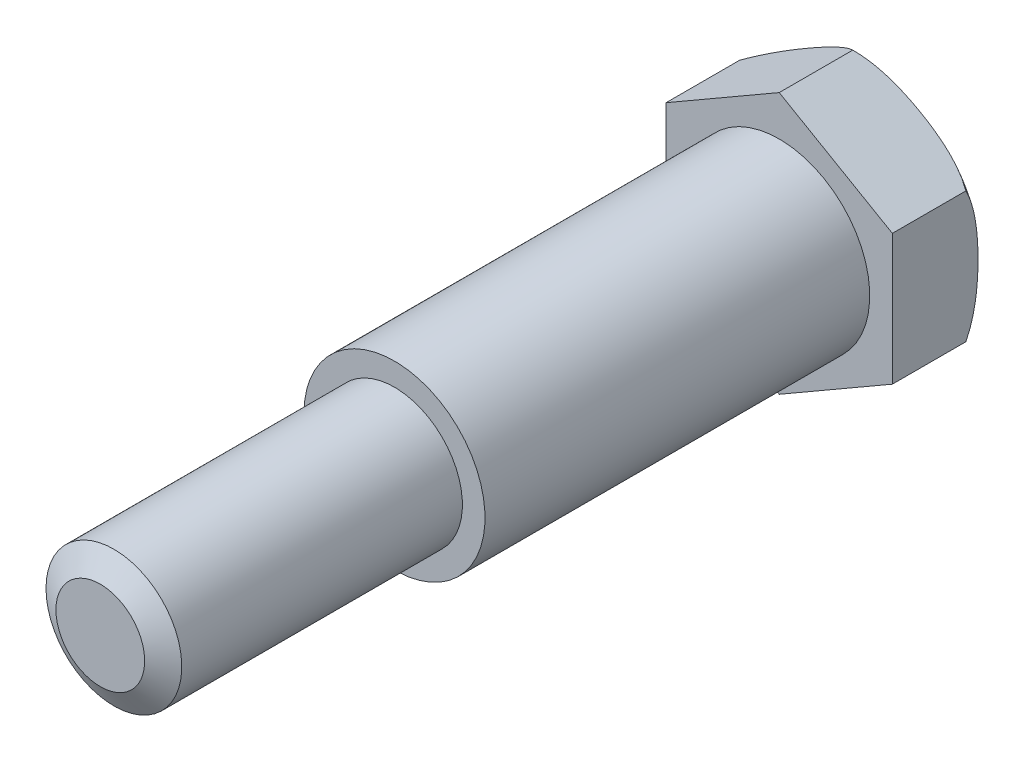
ISO-10303-21;
HEADER;
FILE_DESCRIPTION(('STEP AP214'),'2;1');
FILE_NAME('part.step','',(''),(''),'','','');
FILE_SCHEMA(('AUTOMOTIVE_DESIGN { 1 0 10303 214 1 1 1 1 }'));
ENDSEC;
DATA;
#1=APPLICATION_CONTEXT('core data for automotive mechanical design processes');
#2=APPLICATION_PROTOCOL_DEFINITION('international standard','automotive_design',2000,#1);
#3=PRODUCT_CONTEXT('',#1,'mechanical');
#4=PRODUCT('Part','Part','',(#3));
#5=PRODUCT_RELATED_PRODUCT_CATEGORY('part','',(#4));
#6=PRODUCT_DEFINITION_FORMATION('','',#4);
#7=PRODUCT_DEFINITION_CONTEXT('part definition',#1,'design');
#8=PRODUCT_DEFINITION('design','',#6,#7);
#9=PRODUCT_DEFINITION_SHAPE('','',#8);
#10=(LENGTH_UNIT() NAMED_UNIT(*) SI_UNIT(.MILLI.,.METRE.));
#11=(NAMED_UNIT(*) PLANE_ANGLE_UNIT() SI_UNIT($,.RADIAN.));
#12=(NAMED_UNIT(*) SI_UNIT($,.STERADIAN.) SOLID_ANGLE_UNIT());
#13=UNCERTAINTY_MEASURE_WITH_UNIT(LENGTH_MEASURE(1.E-05),#10,'distance_accuracy_value','');
#14=(GEOMETRIC_REPRESENTATION_CONTEXT(3) GLOBAL_UNCERTAINTY_ASSIGNED_CONTEXT((#13)) GLOBAL_UNIT_ASSIGNED_CONTEXT((#10,
#11,#12)) REPRESENTATION_CONTEXT('',''));
#15=CARTESIAN_POINT('',(0.,0.,0.));
#16=DIRECTION('',(0.,0.,1.));
#17=DIRECTION('',(1.,0.,0.));
#18=AXIS2_PLACEMENT_3D('',#15,#16,#17);
#19=CARTESIAN_POINT('',(0.,0.,21.));
#20=DIRECTION('',(0.,0.,1.));
#21=DIRECTION('',(1.,0.,0.));
#22=AXIS2_PLACEMENT_3D('',#19,#20,#21);
#23=PLANE('',#22);
#24=CARTESIAN_POINT('',(0.,0.,21.));
#25=DIRECTION('',(0.,0.,1.));
#26=DIRECTION('',(1.,0.,0.));
#27=AXIS2_PLACEMENT_3D('',#24,#25,#26);
#28=CIRCLE('',#27,4.);
#29=CARTESIAN_POINT('',(-4.,0.,21.));
#30=VERTEX_POINT('',#29);
#31=EDGE_CURVE('E223',#30,#30,#28,.T.);
#32=ORIENTED_EDGE('',*,*,#31,.T.);
#33=EDGE_LOOP('',(#32));
#34=FACE_BOUND('',#33,.T.);
#35=CARTESIAN_POINT('',(0.,0.,21.));
#36=DIRECTION('',(0.,0.,1.));
#37=DIRECTION('',(1.,0.,0.));
#38=AXIS2_PLACEMENT_3D('',#35,#36,#37);
#39=CIRCLE('',#38,3.);
#40=CARTESIAN_POINT('',(-2.99999999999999,0.,21.));
#41=VERTEX_POINT('',#40);
#42=EDGE_CURVE('E224',#41,#41,#39,.T.);
#43=ORIENTED_EDGE('',*,*,#42,.F.);
#44=EDGE_LOOP('',(#43));
#45=FACE_BOUND('',#44,.T.);
#46=ADVANCED_FACE('F24',(#34,#45),#23,.T.);
#47=CARTESIAN_POINT('',(0.,5.77350269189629,4.));
#48=DIRECTION('',(0.,0.,1.));
#49=DIRECTION('',(1.,0.,0.));
#50=AXIS2_PLACEMENT_3D('',#47,#48,#49);
#51=PLANE('',#50);
#52=DIRECTION('',(-0.866025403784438,0.5,0.));
#53=VECTOR('',#52,1.);
#54=CARTESIAN_POINT('',(4.99999999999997,2.88675134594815,4.));
#55=LINE('',#54,#53);
#56=CARTESIAN_POINT('',(4.99999999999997,2.88675134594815,4.));
#57=VERTEX_POINT('',#56);
#58=CARTESIAN_POINT('',(0.,5.77350269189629,4.));
#59=VERTEX_POINT('',#58);
#60=EDGE_CURVE('E218',#57,#59,#55,.T.);
#61=ORIENTED_EDGE('',*,*,#60,.T.);
#62=DIRECTION('',(-0.866025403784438,-0.5,0.));
#63=VECTOR('',#62,1.);
#64=CARTESIAN_POINT('',(0.,5.77350269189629,4.));
#65=LINE('',#64,#63);
#66=CARTESIAN_POINT('',(-5.00000000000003,2.88675134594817,4.));
#67=VERTEX_POINT('',#66);
#68=EDGE_CURVE('E204',#59,#67,#65,.T.);
#69=ORIENTED_EDGE('',*,*,#68,.T.);
#70=DIRECTION('',(0.,-1.,0.));
#71=VECTOR('',#70,1.);
#72=CARTESIAN_POINT('',(-5.00000000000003,2.88675134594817,4.));
#73=LINE('',#72,#71);
#74=CARTESIAN_POINT('',(-5.00000000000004,-2.8867513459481,4.));
#75=VERTEX_POINT('',#74);
#76=EDGE_CURVE('E98',#67,#75,#73,.T.);
#77=ORIENTED_EDGE('',*,*,#76,.T.);
#78=DIRECTION('',(0.866025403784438,-0.5,0.));
#79=VECTOR('',#78,1.);
#80=CARTESIAN_POINT('',(-5.00000000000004,-2.8867513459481,4.));
#81=LINE('',#80,#79);
#82=CARTESIAN_POINT('',(0.,-5.77350269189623,4.));
#83=VERTEX_POINT('',#82);
#84=EDGE_CURVE('E199',#75,#83,#81,.T.);
#85=ORIENTED_EDGE('',*,*,#84,.T.);
#86=DIRECTION('',(0.866025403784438,0.5,0.));
#87=VECTOR('',#86,1.);
#88=CARTESIAN_POINT('',(0.,-5.77350269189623,4.));
#89=LINE('',#88,#87);
#90=CARTESIAN_POINT('',(4.99999999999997,-2.88675134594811,4.));
#91=VERTEX_POINT('',#90);
#92=EDGE_CURVE('E201',#83,#91,#89,.T.);
#93=ORIENTED_EDGE('',*,*,#92,.T.);
#94=DIRECTION('',(0.,1.,0.));
#95=VECTOR('',#94,1.);
#96=CARTESIAN_POINT('',(4.99999999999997,-2.88675134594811,4.));
#97=LINE('',#96,#95);
#98=EDGE_CURVE('E48',#91,#57,#97,.T.);
#99=ORIENTED_EDGE('',*,*,#98,.T.);
#100=EDGE_LOOP('',(#61,#69,#77,#85,#93,#99));
#101=FACE_BOUND('',#100,.T.);
#102=CARTESIAN_POINT('',(0.,0.,4.));
#103=DIRECTION('',(0.,0.,1.));
#104=DIRECTION('',(1.,0.,0.));
#105=AXIS2_PLACEMENT_3D('',#102,#103,#104);
#106=CIRCLE('',#105,4.);
#107=CARTESIAN_POINT('',(-4.,0.,4.));
#108=VERTEX_POINT('',#107);
#109=EDGE_CURVE('E221',#108,#108,#106,.T.);
#110=ORIENTED_EDGE('',*,*,#109,.F.);
#111=EDGE_LOOP('',(#110));
#112=FACE_BOUND('',#111,.T.);
#113=ADVANCED_FACE('F126',(#101,#112),#51,.T.);
#114=CARTESIAN_POINT('',(4.99999999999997,2.88675134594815,4.));
#115=DIRECTION('',(-0.5,-0.866025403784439,0.));
#116=DIRECTION('',(0.866025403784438,-0.5,0.));
#117=AXIS2_PLACEMENT_3D('',#114,#115,#116);
#118=PLANE('',#117);
#119=DIRECTION('',(0.,0.,-1.));
#120=VECTOR('',#119,1.);
#121=CARTESIAN_POINT('',(4.99999999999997,2.88675134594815,4.));
#122=LINE('',#121,#120);
#123=CARTESIAN_POINT('',(4.99999999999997,2.88675134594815,0.750000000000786));
#124=VERTEX_POINT('',#123);
#125=EDGE_CURVE('E209',#57,#124,#122,.T.);
#126=ORIENTED_EDGE('',*,*,#125,.T.);
#127=CARTESIAN_POINT('',(5.00019999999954,2.88663587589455,0.750117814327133));
#128=CARTESIAN_POINT('',(4.91841205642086,2.93385616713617,0.701964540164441));
#129=CARTESIAN_POINT('',(4.83475354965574,2.98215642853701,0.658318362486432));
#130=CARTESIAN_POINT('',(4.6648047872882,3.08027639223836,0.579129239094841));
#131=CARTESIAN_POINT('',(4.57852070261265,3.13009253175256,0.543568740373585));
#132=CARTESIAN_POINT('',(4.40402751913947,3.23083621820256,0.479424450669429));
#133=CARTESIAN_POINT('',(4.31581764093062,3.28176421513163,0.450843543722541));
#134=CARTESIAN_POINT('',(4.13804944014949,3.38439873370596,0.399719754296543));
#135=CARTESIAN_POINT('',(4.04849028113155,3.43610573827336,0.377180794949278));
#136=CARTESIAN_POINT('',(3.8550726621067,3.54777545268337,0.334331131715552));
#137=CARTESIAN_POINT('',(3.75107696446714,3.60781739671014,0.314856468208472));
#138=CARTESIAN_POINT('',(3.54238396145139,3.72830635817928,0.281675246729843));
#139=CARTESIAN_POINT('',(3.43768646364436,3.78875348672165,0.267970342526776));
#140=CARTESIAN_POINT('',(3.22779422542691,3.90993482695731,0.245453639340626));
#141=CARTESIAN_POINT('',(3.12259907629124,3.97066927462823,0.236647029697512));
#142=CARTESIAN_POINT('',(2.91202017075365,4.09224706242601,0.223338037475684));
#143=CARTESIAN_POINT('',(2.80663643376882,4.15309039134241,0.218835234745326));
#144=CARTESIAN_POINT('',(2.59551554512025,4.27498109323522,0.213794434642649));
#145=CARTESIAN_POINT('',(2.4897782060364,4.33602857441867,0.213267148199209));
#146=CARTESIAN_POINT('',(2.27833668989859,4.4581043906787,0.21616576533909));
#147=CARTESIAN_POINT('',(2.17263251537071,4.51913272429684,0.219591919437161));
#148=CARTESIAN_POINT('',(1.96144359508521,4.64106270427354,0.230650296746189));
#149=CARTESIAN_POINT('',(1.85595875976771,4.70196440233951,0.238280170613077));
#150=CARTESIAN_POINT('',(1.64533731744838,4.8235667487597,0.258285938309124));
#151=CARTESIAN_POINT('',(1.54020066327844,4.88426742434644,0.270661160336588));
#152=CARTESIAN_POINT('',(1.31113210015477,5.01652022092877,0.303766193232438));
#153=CARTESIAN_POINT('',(1.18731688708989,5.08800496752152,0.325617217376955));
#154=CARTESIAN_POINT('',(0.941365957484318,5.23000480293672,0.378866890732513));
#155=CARTESIAN_POINT('',(0.819228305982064,5.30052100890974,0.410253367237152));
#156=CARTESIAN_POINT('',(0.578303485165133,5.43961901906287,0.484573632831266));
#157=CARTESIAN_POINT('',(0.459500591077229,5.50820990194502,0.52743688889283));
#158=CARTESIAN_POINT('',(0.284435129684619,5.60928399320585,0.602347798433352));
#159=CARTESIAN_POINT('',(0.226483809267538,5.64274220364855,0.629155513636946));
#160=CARTESIAN_POINT('',(0.11199152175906,5.7088443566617,0.686648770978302));
#161=CARTESIAN_POINT('',(0.0554517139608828,5.74148762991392,0.717337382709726));
#162=CARTESIAN_POINT('',(-0.000200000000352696,5.7736181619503,0.750117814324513));
#163=B_SPLINE_CURVE_WITH_KNOTS('',3,(#127,#128,#129,#130,#131,#132,#133,#134,#135,#136,#137,
#138,#139,#140,#141,#142,#143,#144,#145,#146,#147,#148,#149,#150,#151,#152,#153,#154,#155,#156,
#157,#158,#159,#160,#161,#162),.UNSPECIFIED.,.F.,.F.,(4,2,2,2,2,2,2,2,2,2,2,2,2,2,2,2,2,4),(0.,
0.317729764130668,0.634763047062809,0.951927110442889,1.2692966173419,1.63408330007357,
1.99897446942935,2.36425147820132,2.72949282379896,3.09571786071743,3.46196610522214,
3.8280098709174,4.19400183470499,4.62762059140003,5.06068811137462,5.49115289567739,
5.70730227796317,5.92362370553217),.UNSPECIFIED.);
#164=CARTESIAN_POINT('',(0.,5.77350269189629,0.750000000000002));
#165=VERTEX_POINT('',#164);
#166=EDGE_CURVE('E40',#124,#165,#163,.T.);
#167=ORIENTED_EDGE('',*,*,#166,.T.);
#168=DIRECTION('',(0.,0.,-1.));
#169=VECTOR('',#168,1.);
#170=CARTESIAN_POINT('',(0.,5.77350269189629,4.));
#171=LINE('',#170,#169);
#172=EDGE_CURVE('E95',#59,#165,#171,.T.);
#173=ORIENTED_EDGE('',*,*,#172,.F.);
#174=ORIENTED_EDGE('',*,*,#60,.F.);
#175=EDGE_LOOP('',(#126,#167,#173,#174));
#176=FACE_BOUND('',#175,.T.);
#177=ADVANCED_FACE('F26',(#176),#118,.F.);
#178=CARTESIAN_POINT('',(0.,5.77350269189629,4.));
#179=DIRECTION('',(0.5,-0.866025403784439,0.));
#180=DIRECTION('',(0.866025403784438,0.5,0.));
#181=AXIS2_PLACEMENT_3D('',#178,#179,#180);
#182=PLANE('',#181);
#183=ORIENTED_EDGE('',*,*,#172,.T.);
#184=CARTESIAN_POINT('',(0.000199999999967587,5.77361816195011,0.750117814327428));
#185=CARTESIAN_POINT('',(-0.081587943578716,5.72639787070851,0.701964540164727));
#186=CARTESIAN_POINT('',(-0.16524645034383,5.67809760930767,0.658318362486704));
#187=CARTESIAN_POINT('',(-0.335195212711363,5.57997764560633,0.579129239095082));
#188=CARTESIAN_POINT('',(-0.421479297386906,5.53016150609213,0.54356874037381));
#189=CARTESIAN_POINT('',(-0.595972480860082,5.42941781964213,0.479424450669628));
#190=CARTESIAN_POINT('',(-0.684182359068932,5.37848982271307,0.45084354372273));
#191=CARTESIAN_POINT('',(-0.861950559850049,5.27585530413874,0.399719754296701));
#192=CARTESIAN_POINT('',(-0.951509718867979,5.22414829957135,0.377180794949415));
#193=CARTESIAN_POINT('',(-1.14492733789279,5.11247858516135,0.334331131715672));
#194=CARTESIAN_POINT('',(-1.24892303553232,5.05243664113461,0.3148564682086));
#195=CARTESIAN_POINT('',(-1.457616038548,4.93194767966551,0.281675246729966));
#196=CARTESIAN_POINT('',(-1.56231353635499,4.87150055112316,0.267970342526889));
#197=CARTESIAN_POINT('',(-1.77220577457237,4.75031921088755,0.245453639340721));
#198=CARTESIAN_POINT('',(-1.877400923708,4.68958476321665,0.2366470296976));
#199=CARTESIAN_POINT('',(-2.08797982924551,4.56800697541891,0.223338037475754));
#200=CARTESIAN_POINT('',(-2.19336356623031,4.50716364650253,0.218835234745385));
#201=CARTESIAN_POINT('',(-2.40448445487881,4.38527294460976,0.213794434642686));
#202=CARTESIAN_POINT('',(-2.51022179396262,4.32422546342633,0.213267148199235));
#203=CARTESIAN_POINT('',(-2.72166331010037,4.20214964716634,0.216165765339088));
#204=CARTESIAN_POINT('',(-2.82736748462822,4.14112131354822,0.219591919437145));
#205=CARTESIAN_POINT('',(-3.03855640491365,4.01919133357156,0.230650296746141));
#206=CARTESIAN_POINT('',(-3.14404124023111,3.9582896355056,0.238280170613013));
#207=CARTESIAN_POINT('',(-3.35466268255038,3.83668728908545,0.258285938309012));
#208=CARTESIAN_POINT('',(-3.4597993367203,3.77598661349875,0.270661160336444));
#209=CARTESIAN_POINT('',(-3.68886789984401,3.64373381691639,0.303766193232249));
#210=CARTESIAN_POINT('',(-3.81268311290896,3.57224907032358,0.325617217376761));
#211=CARTESIAN_POINT('',(-4.05863404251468,3.43024923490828,0.378866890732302));
#212=CARTESIAN_POINT('',(-4.18077169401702,3.35973302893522,0.41025336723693));
#213=CARTESIAN_POINT('',(-4.42169651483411,3.22063501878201,0.484573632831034));
#214=CARTESIAN_POINT('',(-4.54049940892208,3.15204413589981,0.527436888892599));
#215=CARTESIAN_POINT('',(-4.71556487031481,3.05097004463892,0.60234779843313));
#216=CARTESIAN_POINT('',(-4.77351619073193,3.0175118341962,0.629155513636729));
#217=CARTESIAN_POINT('',(-4.88800847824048,2.951409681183,0.686648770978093));
#218=CARTESIAN_POINT('',(-4.9445482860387,2.91876640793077,0.717337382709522));
#219=CARTESIAN_POINT('',(-5.00019999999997,2.88663587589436,0.750117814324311));
#220=B_SPLINE_CURVE_WITH_KNOTS('',3,(#184,#185,#186,#187,#188,#189,#190,#191,#192,#193,#194,
#195,#196,#197,#198,#199,#200,#201,#202,#203,#204,#205,#206,#207,#208,#209,#210,#211,#212,#213,
#214,#215,#216,#217,#218,#219),.UNSPECIFIED.,.F.,.F.,(4,2,2,2,2,2,2,2,2,2,2,2,2,2,2,2,2,4),(0.,
0.31772976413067,0.634763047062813,0.95192711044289,1.2692966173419,1.63408330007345,
1.9989744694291,2.36425147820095,2.72949282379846,3.09571786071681,3.46196610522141,
3.82800987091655,4.19400183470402,4.62762059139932,5.06068811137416,5.49115289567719,
5.70730227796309,5.92362370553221),.UNSPECIFIED.);
#221=CARTESIAN_POINT('',(-5.00000000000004,2.88675134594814,0.750000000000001));
#222=VERTEX_POINT('',#221);
#223=EDGE_CURVE('E80',#165,#222,#220,.T.);
#224=ORIENTED_EDGE('',*,*,#223,.T.);
#225=DIRECTION('',(0.,0.,-1.));
#226=VECTOR('',#225,1.);
#227=CARTESIAN_POINT('',(-5.00000000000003,2.88675134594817,4.));
#228=LINE('',#227,#226);
#229=EDGE_CURVE('E92',#67,#222,#228,.T.);
#230=ORIENTED_EDGE('',*,*,#229,.F.);
#231=ORIENTED_EDGE('',*,*,#68,.F.);
#232=EDGE_LOOP('',(#183,#224,#230,#231));
#233=FACE_BOUND('',#232,.T.);
#234=ADVANCED_FACE('F91',(#233),#182,.F.);
#235=CARTESIAN_POINT('',(-5.00000000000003,2.88675134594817,4.));
#236=DIRECTION('',(1.,0.,0.));
#237=DIRECTION('',(0.,1.,0.));
#238=AXIS2_PLACEMENT_3D('',#235,#236,#237);
#239=PLANE('',#238);
#240=ORIENTED_EDGE('',*,*,#229,.T.);
#241=CARTESIAN_POINT('',(-5.00000008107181,0.,0.213922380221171));
#242=CARTESIAN_POINT('',(-5.00000007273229,-0.106099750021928,0.213924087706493));
#243=CARTESIAN_POINT('',(-5.00000001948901,-0.212197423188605,0.215410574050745));
#244=CARTESIAN_POINT('',(-4.99999998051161,-0.424305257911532,0.221444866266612));
#245=CARTESIAN_POINT('',(-4.99999999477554,-0.530315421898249,0.225992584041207));
#246=CARTESIAN_POINT('',(-5.00000000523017,-0.742260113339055,0.238405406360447));
#247=CARTESIAN_POINT('',(-5.00000000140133,-0.848194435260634,0.246274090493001));
#248=CARTESIAN_POINT('',(-4.99999999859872,-1.0597244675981,0.265743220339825));
#249=CARTESIAN_POINT('',(-4.99999999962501,-1.16532017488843,0.277343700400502));
#250=CARTESIAN_POINT('',(-5.00000000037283,-1.37534104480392,0.304761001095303));
#251=CARTESIAN_POINT('',(-5.00000000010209,-1.47976943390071,0.320552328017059));
#252=CARTESIAN_POINT('',(-4.99999999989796,-1.68775539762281,0.357073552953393));
#253=CARTESIAN_POINT('',(-4.99999999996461,-1.79131285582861,0.377804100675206));
#254=CARTESIAN_POINT('',(-5.00000000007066,-2.0996103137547,0.448503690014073));
#255=CARTESIAN_POINT('',(-5.00000000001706,-2.30258181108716,0.50705035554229));
#256=CARTESIAN_POINT('',(-4.99999999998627,-2.65957588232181,0.640323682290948));
#257=CARTESIAN_POINT('',(-4.9999999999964,-2.81552339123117,0.709797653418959));
#258=CARTESIAN_POINT('',(-5.00000000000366,-3.11442931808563,0.87267685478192));
#259=CARTESIAN_POINT('',(-5.00000000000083,-3.25742082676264,0.966018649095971));
#260=CARTESIAN_POINT('',(-4.9999999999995,-3.47896089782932,1.14478636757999));
#261=CARTESIAN_POINT('',(-4.99999999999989,-3.56335818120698,1.22294099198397));
#262=CARTESIAN_POINT('',(-5.00000000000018,-3.71887326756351,1.39161319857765));
#263=CARTESIAN_POINT('',(-5.00000000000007,-3.7900017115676,1.48212077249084));
#264=CARTESIAN_POINT('',(-5.00000000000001,-3.90574286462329,1.66021789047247));
#265=CARTESIAN_POINT('',(-5.00000000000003,-3.95272043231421,1.74626323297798));
#266=CARTESIAN_POINT('',(-5.00000000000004,-4.0316787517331,1.92501380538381));
#267=CARTESIAN_POINT('',(-5.00000000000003,-4.06366737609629,2.0177155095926));
#268=CARTESIAN_POINT('',(-5.00000000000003,-4.11078513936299,2.20781344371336));
#269=CARTESIAN_POINT('',(-5.00000000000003,-4.12583554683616,2.30522941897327));
#270=CARTESIAN_POINT('',(-5.00000000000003,-4.13774956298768,2.50117211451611));
#271=CARTESIAN_POINT('',(-5.00000000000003,-4.13461649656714,2.59969862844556));
#272=CARTESIAN_POINT('',(-5.00000000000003,-4.11138775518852,2.786631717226));
#273=CARTESIAN_POINT('',(-5.00000000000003,-4.09267593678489,2.87521510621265));
#274=CARTESIAN_POINT('',(-5.00000000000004,-4.04117971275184,3.04815021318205));
#275=CARTESIAN_POINT('',(-5.00000000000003,-4.00839565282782,3.13250203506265));
#276=CARTESIAN_POINT('',(-5.00000000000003,-3.92891774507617,3.29836260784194));
#277=CARTESIAN_POINT('',(-5.00000000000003,-3.88173495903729,3.37963522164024));
#278=CARTESIAN_POINT('',(-5.00000000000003,-3.77617897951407,3.5345227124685));
#279=CARTESIAN_POINT('',(-5.00000000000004,-3.71779844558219,3.60813251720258));
#280=CARTESIAN_POINT('',(-5.00000000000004,-3.5614951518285,3.78084329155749));
#281=CARTESIAN_POINT('',(-5.00000000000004,-3.45811726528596,3.8750187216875));
#282=CARTESIAN_POINT('',(-5.00000000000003,-3.23768215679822,4.04549671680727));
#283=CARTESIAN_POINT('',(-5.00000000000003,-3.12060275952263,4.12176969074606));
#284=CARTESIAN_POINT('',(-5.00000000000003,-2.811236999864,4.29524738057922));
#285=CARTESIAN_POINT('',(-5.00000000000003,-2.61269490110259,4.38125652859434));
#286=CARTESIAN_POINT('',(-5.00000000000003,-2.3072258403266,4.48737972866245));
#287=CARTESIAN_POINT('',(-5.00000000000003,-2.203879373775,4.51898532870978));
#288=CARTESIAN_POINT('',(-5.00000000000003,-1.99537126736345,4.57556019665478));
#289=CARTESIAN_POINT('',(-5.00000000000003,-1.8902100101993,4.60053084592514));
#290=CARTESIAN_POINT('',(-5.00000000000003,-1.67188309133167,4.6461946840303));
#291=CARTESIAN_POINT('',(-5.00000000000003,-1.55863981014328,4.66650652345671));
#292=CARTESIAN_POINT('',(-5.00000000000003,-1.33129248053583,4.70166161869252));
#293=CARTESIAN_POINT('',(-5.00000000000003,-1.21718823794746,4.71650360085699));
#294=CARTESIAN_POINT('',(-5.00000000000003,-0.988327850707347,4.74153866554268));
#295=CARTESIAN_POINT('',(-5.00000000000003,-0.873571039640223,4.75172552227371));
#296=CARTESIAN_POINT('',(-5.00000000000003,-0.643784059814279,4.76803334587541));
#297=CARTESIAN_POINT('',(-5.00000000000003,-0.528753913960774,4.77415464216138));
#298=CARTESIAN_POINT('',(-5.00000000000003,-0.29855761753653,4.78272586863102));
#299=CARTESIAN_POINT('',(-5.00000000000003,-0.183391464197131,4.78517572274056));
#300=CARTESIAN_POINT('',(-5.00000000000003,0.0469675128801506,4.78656743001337));
#301=CARTESIAN_POINT('',(-5.00000000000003,0.162160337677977,4.78550910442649));
#302=CARTESIAN_POINT('',(-5.00000000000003,0.392346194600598,4.77981562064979));
#303=CARTESIAN_POINT('',(-5.00000000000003,0.507339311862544,4.77518397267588));
#304=CARTESIAN_POINT('',(-5.00000000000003,0.737095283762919,4.76204667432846));
#305=CARTESIAN_POINT('',(-5.00000000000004,0.851858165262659,4.75354150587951));
#306=CARTESIAN_POINT('',(-5.00000000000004,1.07004132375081,4.7331523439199));
#307=CARTESIAN_POINT('',(-5.00000000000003,1.17349851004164,4.72166842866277));
#308=CARTESIAN_POINT('',(-5.00000000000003,1.37988018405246,4.69456183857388));
#309=CARTESIAN_POINT('',(-5.00000000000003,1.48280465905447,4.67893906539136));
#310=CARTESIAN_POINT('',(-5.00000000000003,1.68783608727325,4.64288755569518));
#311=CARTESIAN_POINT('',(-5.00000000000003,1.78994293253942,4.62245819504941));
#312=CARTESIAN_POINT('',(-5.00000000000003,1.99288813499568,4.57602067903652));
#313=CARTESIAN_POINT('',(-5.00000000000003,2.09372652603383,4.55001267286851));
#314=CARTESIAN_POINT('',(-5.00000000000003,2.29507699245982,4.49108648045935));
#315=CARTESIAN_POINT('',(-5.00000000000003,2.39556085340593,4.45806934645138));
#316=CARTESIAN_POINT('',(-5.00000000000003,2.59367742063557,4.38443803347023));
#317=CARTESIAN_POINT('',(-5.00000000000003,2.69130937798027,4.34382187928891));
#318=CARTESIAN_POINT('',(-5.00000000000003,2.97765045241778,4.2092328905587));
#319=CARTESIAN_POINT('',(-5.00000000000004,3.1608450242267,4.10224267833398));
#320=CARTESIAN_POINT('',(-5.00000000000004,3.41996795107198,3.90575178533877));
#321=CARTESIAN_POINT('',(-5.00000000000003,3.50674934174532,3.83047958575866));
#322=CARTESIAN_POINT('',(-5.00000000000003,3.66795725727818,3.66751481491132));
#323=CARTESIAN_POINT('',(-5.00000000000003,3.74238652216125,3.57982500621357));
#324=CARTESIAN_POINT('',(-5.00000000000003,3.87561789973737,3.39177533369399));
#325=CARTESIAN_POINT('',(-5.00000000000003,3.93425335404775,3.29129566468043));
#326=CARTESIAN_POINT('',(-5.00000000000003,4.03065972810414,3.08073998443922));
#327=CARTESIAN_POINT('',(-5.00000000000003,4.06845500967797,2.9706753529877));
#328=CARTESIAN_POINT('',(-5.00000000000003,4.11653223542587,2.76014280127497));
#329=CARTESIAN_POINT('',(-5.00000000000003,4.12981614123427,2.660358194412));
#330=CARTESIAN_POINT('',(-5.00000000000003,4.13737689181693,2.46008545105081));
#331=CARTESIAN_POINT('',(-5.00000000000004,4.13166324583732,2.35959769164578));
#332=CARTESIAN_POINT('',(-5.00000000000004,4.10319269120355,2.17144367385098));
#333=CARTESIAN_POINT('',(-5.00000000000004,4.08220183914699,2.08350198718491));
#334=CARTESIAN_POINT('',(-5.00000000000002,4.02641619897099,1.91214952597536));
#335=CARTESIAN_POINT('',(-5.00000000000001,3.99162110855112,1.82873885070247));
#336=CARTESIAN_POINT('',(-5.00000000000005,3.90797395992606,1.66421431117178));
#337=CARTESIAN_POINT('',(-5.00000000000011,3.8585225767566,1.58340747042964));
#338=CARTESIAN_POINT('',(-4.99999999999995,3.74861283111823,1.42971946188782));
#339=CARTESIAN_POINT('',(-4.99999999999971,3.68814907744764,1.35684220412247));
#340=CARTESIAN_POINT('',(-5.00000000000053,3.52554375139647,1.18469388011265));
#341=CARTESIAN_POINT('',(-5.00000000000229,3.41778845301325,1.09071303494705));
#342=CARTESIAN_POINT('',(-4.99999999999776,3.18864660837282,0.921200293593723));
#343=CARTESIAN_POINT('',(-4.99999999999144,3.06722769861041,0.845713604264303));
#344=CARTESIAN_POINT('',(-5.00000000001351,2.74406212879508,0.673144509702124));
#345=CARTESIAN_POINT('',(-5.00000000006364,2.53587858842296,0.58816806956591));
#346=CARTESIAN_POINT('',(-4.99999999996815,2.21646336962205,0.484541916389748));
#347=CARTESIAN_POINT('',(-4.99999999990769,2.1086703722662,0.453951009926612));
#348=CARTESIAN_POINT('',(-5.00000000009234,1.89137187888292,0.399573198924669));
#349=CARTESIAN_POINT('',(-5.00000000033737,1.78186681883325,0.375784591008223));
#350=CARTESIAN_POINT('',(-4.99999999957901,1.53449042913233,0.328826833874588));
#351=CARTESIAN_POINT('',(-4.99999999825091,1.39631978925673,0.307274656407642));
#352=CARTESIAN_POINT('',(-5.00000000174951,1.11902592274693,0.271547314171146));
#353=CARTESIAN_POINT('',(-5.00000000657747,0.979902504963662,0.25737367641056));
#354=CARTESIAN_POINT('',(-4.99999999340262,0.700757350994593,0.235155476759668));
#355=CARTESIAN_POINT('',(-4.99999997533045,0.560734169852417,0.227129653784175));
#356=CARTESIAN_POINT('',(-5.00000002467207,0.280472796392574,0.216511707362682));
#357=CARTESIAN_POINT('',(-5.00000009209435,0.140234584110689,0.213920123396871));
#358=CARTESIAN_POINT('',(-5.00000008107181,0.,0.213922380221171));
#359=B_SPLINE_CURVE_WITH_KNOTS('',3,(#241,#242,#243,#244,#245,#246,#247,#248,#249,#250,#251,
#252,#253,#254,#255,#256,#257,#258,#259,#260,#261,#262,#263,#264,#265,#266,#267,#268,#269,#270,
#271,#272,#273,#274,#275,#276,#277,#278,#279,#280,#281,#282,#283,#284,#285,#286,#287,#288,#289,
#290,#291,#292,#293,#294,#295,#296,#297,#298,#299,#300,#301,#302,#303,#304,#305,#306,#307,#308,
#309,#310,#311,#312,#313,#314,#315,#316,#317,#318,#319,#320,#321,#322,#323,#324,#325,#326,#327,
#328,#329,#330,#331,#332,#333,#334,#335,#336,#337,#338,#339,#340,#341,#342,#343,#344,#345,#346,
#347,#348,#349,#350,#351,#352,#353,#354,#355,#356,#357,#358),.UNSPECIFIED.,.T.,.F.,(4,2,2,2,2,2,
2,2,2,2,2,2,2,2,2,2,2,2,2,2,2,2,2,2,2,2,2,2,2,2,2,2,2,2,2,2,2,2,2,2,2,2,2,2,2,2,2,2,2,2,2,2,2,2,
2,2,2,2,4),(0.,0.318284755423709,0.636560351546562,0.955179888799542,1.27380235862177,
1.59052933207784,1.90729799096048,2.53901169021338,3.04963470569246,3.55891444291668,
3.90282574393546,4.24646004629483,4.53932880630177,4.83204357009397,5.12611336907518,
5.42012939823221,5.69050973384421,5.96088342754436,6.24171415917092,6.52272961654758,
6.93987759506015,7.35771029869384,8.00291479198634,8.32701670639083,8.65105109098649,
8.99605344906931,9.34113608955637,9.68667890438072,10.032193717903,10.3777156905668,
10.7232552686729,11.0684558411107,11.4136134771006,11.7258202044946,12.0380343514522,
12.3502890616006,12.6625354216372,12.9795239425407,13.2965949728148,13.9275410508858,
14.2711179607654,14.6146185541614,14.9616131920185,15.308201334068,15.6084696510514,
15.9085876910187,16.1786181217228,16.4486544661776,16.7317726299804,17.0150297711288,
17.4415329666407,17.8690685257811,18.5395676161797,18.8756102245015,19.2115686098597,
19.6308514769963,20.0502210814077,20.4708639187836,20.8915485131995),.UNSPECIFIED.);
#360=CARTESIAN_POINT('',(-5.00000000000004,-2.88675134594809,0.750000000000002));
#361=VERTEX_POINT('',#360);
#362=EDGE_CURVE('E77',#222,#361,#359,.T.);
#363=ORIENTED_EDGE('',*,*,#362,.T.);
#364=DIRECTION('',(0.,0.,-1.));
#365=VECTOR('',#364,1.);
#366=CARTESIAN_POINT('',(-5.00000000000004,-2.8867513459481,4.));
#367=LINE('',#366,#365);
#368=EDGE_CURVE('E99',#75,#361,#367,.T.);
#369=ORIENTED_EDGE('',*,*,#368,.F.);
#370=ORIENTED_EDGE('',*,*,#76,.F.);
#371=EDGE_LOOP('',(#240,#363,#369,#370));
#372=FACE_BOUND('',#371,.T.);
#373=ADVANCED_FACE('F97',(#372),#239,.F.);
#374=CARTESIAN_POINT('',(-5.00000000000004,-2.8867513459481,4.));
#375=DIRECTION('',(0.5,0.866025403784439,0.));
#376=DIRECTION('',(-0.866025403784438,0.5,0.));
#377=AXIS2_PLACEMENT_3D('',#374,#375,#376);
#378=PLANE('',#377);
#379=ORIENTED_EDGE('',*,*,#368,.T.);
#380=CARTESIAN_POINT('',(-5.0001999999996,-2.88663587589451,0.75011781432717));
#381=CARTESIAN_POINT('',(-4.91841205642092,-2.93385616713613,0.70196454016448));
#382=CARTESIAN_POINT('',(-4.8347535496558,-2.98215642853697,0.65831836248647));
#383=CARTESIAN_POINT('',(-4.66480478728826,-3.08027639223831,0.579129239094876));
#384=CARTESIAN_POINT('',(-4.57852070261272,-3.13009253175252,0.543568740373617));
#385=CARTESIAN_POINT('',(-4.40402751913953,-3.23083621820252,0.479424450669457));
#386=CARTESIAN_POINT('',(-4.31581764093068,-3.28176421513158,0.450843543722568));
#387=CARTESIAN_POINT('',(-4.13804944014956,-3.38439873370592,0.399719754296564));
#388=CARTESIAN_POINT('',(-4.04849028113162,-3.43610573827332,0.377180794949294));
#389=CARTESIAN_POINT('',(-3.85507266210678,-3.54777545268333,0.334331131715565));
#390=CARTESIAN_POINT('',(-3.75107696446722,-3.60781739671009,0.314856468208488));
#391=CARTESIAN_POINT('',(-3.54238396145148,-3.72830635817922,0.281675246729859));
#392=CARTESIAN_POINT('',(-3.43768646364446,-3.78875348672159,0.26797034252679));
#393=CARTESIAN_POINT('',(-3.22779422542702,-3.90993482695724,0.245453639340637));
#394=CARTESIAN_POINT('',(-3.12259907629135,-3.97066927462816,0.236647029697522));
#395=CARTESIAN_POINT('',(-2.91202017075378,-4.09224706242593,0.223338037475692));
#396=CARTESIAN_POINT('',(-2.80663643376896,-4.15309039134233,0.218835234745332));
#397=CARTESIAN_POINT('',(-2.5955155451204,-4.27498109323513,0.213794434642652));
#398=CARTESIAN_POINT('',(-2.48977820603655,-4.33602857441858,0.21326714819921));
#399=CARTESIAN_POINT('',(-2.27833668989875,-4.4581043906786,0.216165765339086));
#400=CARTESIAN_POINT('',(-2.17263251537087,-4.51913272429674,0.219591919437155));
#401=CARTESIAN_POINT('',(-1.96144359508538,-4.64106270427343,0.230650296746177));
#402=CARTESIAN_POINT('',(-1.8559587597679,-4.70196440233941,0.238280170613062));
#403=CARTESIAN_POINT('',(-1.64533731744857,-4.82356674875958,0.258285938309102));
#404=CARTESIAN_POINT('',(-1.54020066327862,-4.88426742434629,0.270661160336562));
#405=CARTESIAN_POINT('',(-1.31113210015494,-5.01652022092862,0.303766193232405));
#406=CARTESIAN_POINT('',(-1.18731688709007,-5.0880049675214,0.325617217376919));
#407=CARTESIAN_POINT('',(-0.941365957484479,-5.23000480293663,0.378866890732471));
#408=CARTESIAN_POINT('',(-0.81922830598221,-5.30052100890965,0.410253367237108));
#409=CARTESIAN_POINT('',(-0.578303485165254,-5.43961901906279,0.484573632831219));
#410=CARTESIAN_POINT('',(-0.459500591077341,-5.50820990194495,0.527436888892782));
#411=CARTESIAN_POINT('',(-0.284435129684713,-5.60928399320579,0.602347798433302));
#412=CARTESIAN_POINT('',(-0.226483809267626,-5.64274220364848,0.629155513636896));
#413=CARTESIAN_POINT('',(-0.111991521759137,-5.70884435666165,0.686648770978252));
#414=CARTESIAN_POINT('',(-0.0554517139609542,-5.74148762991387,0.717337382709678));
#415=CARTESIAN_POINT('',(0.000200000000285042,-5.77361816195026,0.750117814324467));
#416=B_SPLINE_CURVE_WITH_KNOTS('',3,(#380,#381,#382,#383,#384,#385,#386,#387,#388,#389,#390,
#391,#392,#393,#394,#395,#396,#397,#398,#399,#400,#401,#402,#403,#404,#405,#406,#407,#408,#409,
#410,#411,#412,#413,#414,#415),.UNSPECIFIED.,.F.,.F.,(4,2,2,2,2,2,2,2,2,2,2,2,2,2,2,2,2,4),(0.,
0.317729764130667,0.634763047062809,0.95192711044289,1.2692966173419,1.63408330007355,
1.99897446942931,2.36425147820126,2.72949282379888,3.09571786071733,3.46196610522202,
3.82800987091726,4.19400183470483,4.62762059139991,5.06068811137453,5.49115289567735,
5.70730227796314,5.92362370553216),.UNSPECIFIED.);
#417=CARTESIAN_POINT('',(0.,-5.77350269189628,0.750000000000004));
#418=VERTEX_POINT('',#417);
#419=EDGE_CURVE('E82',#361,#418,#416,.T.);
#420=ORIENTED_EDGE('',*,*,#419,.T.);
#421=DIRECTION('',(0.,0.,-1.));
#422=VECTOR('',#421,1.);
#423=CARTESIAN_POINT('',(0.,-5.77350269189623,4.));
#424=LINE('',#423,#422);
#425=EDGE_CURVE('E102',#83,#418,#424,.T.);
#426=ORIENTED_EDGE('',*,*,#425,.F.);
#427=ORIENTED_EDGE('',*,*,#84,.F.);
#428=EDGE_LOOP('',(#379,#420,#426,#427));
#429=FACE_BOUND('',#428,.T.);
#430=ADVANCED_FACE('F188',(#429),#378,.F.);
#431=CARTESIAN_POINT('',(0.,-5.77350269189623,4.));
#432=DIRECTION('',(-0.5,0.866025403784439,0.));
#433=DIRECTION('',(-0.866025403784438,-0.5,0.));
#434=AXIS2_PLACEMENT_3D('',#431,#432,#433);
#435=PLANE('',#434);
#436=ORIENTED_EDGE('',*,*,#425,.T.);
#437=CARTESIAN_POINT('',(-0.000200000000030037,-5.77361816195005,0.750117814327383));
#438=CARTESIAN_POINT('',(0.0815879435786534,-5.72639787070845,0.701964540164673));
#439=CARTESIAN_POINT('',(0.165246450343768,-5.67809760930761,0.658318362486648));
#440=CARTESIAN_POINT('',(0.335195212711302,-5.57997764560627,0.579129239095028));
#441=CARTESIAN_POINT('',(0.421479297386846,-5.53016150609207,0.543568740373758));
#442=CARTESIAN_POINT('',(0.595972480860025,-5.42941781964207,0.479424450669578));
#443=CARTESIAN_POINT('',(0.684182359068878,-5.37848982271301,0.450843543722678));
#444=CARTESIAN_POINT('',(0.861950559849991,-5.27585530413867,0.399719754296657));
#445=CARTESIAN_POINT('',(0.951509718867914,-5.22414829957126,0.377180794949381));
#446=CARTESIAN_POINT('',(1.14492733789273,-5.11247858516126,0.334331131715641));
#447=CARTESIAN_POINT('',(1.24892303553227,-5.05243664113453,0.314856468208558));
#448=CARTESIAN_POINT('',(1.45761603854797,-4.93194767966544,0.281675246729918));
#449=CARTESIAN_POINT('',(1.56231353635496,-4.87150055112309,0.267970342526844));
#450=CARTESIAN_POINT('',(1.77220577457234,-4.75031921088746,0.24545363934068));
#451=CARTESIAN_POINT('',(1.87740092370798,-4.68958476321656,0.236647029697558));
#452=CARTESIAN_POINT('',(2.0879798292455,-4.56800697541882,0.223338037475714));
#453=CARTESIAN_POINT('',(2.1933635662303,-4.50716364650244,0.218835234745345));
#454=CARTESIAN_POINT('',(2.40448445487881,-4.38527294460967,0.213794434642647));
#455=CARTESIAN_POINT('',(2.51022179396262,-4.32422546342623,0.213267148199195));
#456=CARTESIAN_POINT('',(2.72166331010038,-4.20214964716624,0.21616576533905));
#457=CARTESIAN_POINT('',(2.82736748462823,-4.14112131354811,0.219591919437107));
#458=CARTESIAN_POINT('',(3.03855640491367,-4.01919133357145,0.230650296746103));
#459=CARTESIAN_POINT('',(3.14404124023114,-3.95828963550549,0.238280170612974));
#460=CARTESIAN_POINT('',(3.35466268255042,-3.83668728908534,0.258285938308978));
#461=CARTESIAN_POINT('',(3.45979933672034,-3.77598661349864,0.270661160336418));
#462=CARTESIAN_POINT('',(3.68886789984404,-3.64373381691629,0.303766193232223));
#463=CARTESIAN_POINT('',(3.81268311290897,-3.57224907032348,0.325617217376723));
#464=CARTESIAN_POINT('',(4.05863404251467,-3.4302492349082,0.37886689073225));
#465=CARTESIAN_POINT('',(4.18077169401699,-3.35973302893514,0.410253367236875));
#466=CARTESIAN_POINT('',(4.42169651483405,-3.22063501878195,0.484573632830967));
#467=CARTESIAN_POINT('',(4.54049940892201,-3.15204413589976,0.527436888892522));
#468=CARTESIAN_POINT('',(4.71556487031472,-3.05097004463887,0.602347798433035));
#469=CARTESIAN_POINT('',(4.77351619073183,-3.01751183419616,0.629155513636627));
#470=CARTESIAN_POINT('',(4.88800847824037,-2.95140968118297,0.686648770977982));
#471=CARTESIAN_POINT('',(4.94454828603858,-2.91876640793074,0.717337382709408));
#472=CARTESIAN_POINT('',(5.00019999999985,-2.88663587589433,0.7501178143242));
#473=B_SPLINE_CURVE_WITH_KNOTS('',3,(#437,#438,#439,#440,#441,#442,#443,#444,#445,#446,#447,
#448,#449,#450,#451,#452,#453,#454,#455,#456,#457,#458,#459,#460,#461,#462,#463,#464,#465,#466,
#467,#468,#469,#470,#471,#472),.UNSPECIFIED.,.F.,.F.,(4,2,2,2,2,2,2,2,2,2,2,2,2,2,2,2,2,4),(0.,
0.317729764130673,0.634763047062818,0.951927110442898,1.26929661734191,1.63408330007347,
1.99897446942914,2.364251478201,2.72949282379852,3.09571786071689,3.4619661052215,
3.82800987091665,4.19400183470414,4.62762059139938,5.06068811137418,5.49115289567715,
5.70730227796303,5.92362370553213),.UNSPECIFIED.);
#474=CARTESIAN_POINT('',(4.99999999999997,-2.88675134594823,0.750000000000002));
#475=VERTEX_POINT('',#474);
#476=EDGE_CURVE('E158',#418,#475,#473,.T.);
#477=ORIENTED_EDGE('',*,*,#476,.T.);
#478=DIRECTION('',(0.,0.,-1.));
#479=VECTOR('',#478,1.);
#480=CARTESIAN_POINT('',(4.99999999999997,-2.88675134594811,4.));
#481=LINE('',#480,#479);
#482=EDGE_CURVE('E212',#91,#475,#481,.T.);
#483=ORIENTED_EDGE('',*,*,#482,.F.);
#484=ORIENTED_EDGE('',*,*,#92,.F.);
#485=EDGE_LOOP('',(#436,#477,#483,#484));
#486=FACE_BOUND('',#485,.T.);
#487=ADVANCED_FACE('F148',(#486),#435,.F.);
#488=CARTESIAN_POINT('',(4.99999999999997,-2.88675134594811,4.));
#489=DIRECTION('',(-1.,0.,0.));
#490=DIRECTION('',(0.,0.,1.));
#491=AXIS2_PLACEMENT_3D('',#488,#489,#490);
#492=PLANE('',#491);
#493=ORIENTED_EDGE('',*,*,#482,.T.);
#494=CARTESIAN_POINT('',(4.99999999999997,0.,0.213922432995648));
#495=CARTESIAN_POINT('',(4.99999999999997,0.106099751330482,0.213924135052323));
#496=CARTESIAN_POINT('',(4.99999999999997,0.212197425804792,0.215410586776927));
#497=CARTESIAN_POINT('',(4.99999999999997,0.424305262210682,0.22144485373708));
#498=CARTESIAN_POINT('',(4.99999999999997,0.53031542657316,0.225992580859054));
#499=CARTESIAN_POINT('',(4.99999999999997,0.742260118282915,0.238405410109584));
#500=CARTESIAN_POINT('',(4.99999999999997,0.848194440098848,0.246274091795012));
#501=CARTESIAN_POINT('',(4.99999999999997,1.05972447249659,0.265743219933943));
#502=CARTESIAN_POINT('',(4.99999999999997,1.16532017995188,0.277343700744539));
#503=CARTESIAN_POINT('',(4.99999999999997,1.37534104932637,0.304761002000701));
#504=CARTESIAN_POINT('',(4.99999999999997,1.47976943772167,0.320552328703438));
#505=CARTESIAN_POINT('',(4.99999999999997,1.68775540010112,0.357073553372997));
#506=CARTESIAN_POINT('',(4.99999999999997,1.79131285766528,0.377804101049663));
#507=CARTESIAN_POINT('',(4.99999999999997,2.09961031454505,0.448503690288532));
#508=CARTESIAN_POINT('',(4.99999999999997,2.30258181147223,0.507050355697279));
#509=CARTESIAN_POINT('',(4.99999999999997,2.65957588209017,0.640323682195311));
#510=CARTESIAN_POINT('',(4.99999999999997,2.81552339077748,0.709797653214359));
#511=CARTESIAN_POINT('',(4.99999999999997,3.11442931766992,0.872676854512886));
#512=CARTESIAN_POINT('',(4.99999999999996,3.2574208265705,0.96601864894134));
#513=CARTESIAN_POINT('',(4.99999999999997,3.47896089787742,1.14478636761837));
#514=CARTESIAN_POINT('',(4.99999999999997,3.5633581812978,1.22294099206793));
#515=CARTESIAN_POINT('',(4.99999999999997,3.71887326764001,1.39161319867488));
#516=CARTESIAN_POINT('',(4.99999999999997,3.79000171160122,1.48212077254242));
#517=CARTESIAN_POINT('',(4.99999999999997,3.90574286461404,1.66021789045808));
#518=CARTESIAN_POINT('',(4.99999999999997,3.95272043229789,1.74626323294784));
#519=CARTESIAN_POINT('',(4.99999999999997,4.031678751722,1.92501380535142));
#520=CARTESIAN_POINT('',(4.99999999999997,4.06366737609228,2.01771550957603));
#521=CARTESIAN_POINT('',(4.99999999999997,4.11078513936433,2.20781344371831));
#522=CARTESIAN_POINT('',(4.99999999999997,4.12583554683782,2.30522941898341));
#523=CARTESIAN_POINT('',(4.99999999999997,4.13774956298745,2.50117211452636));
#524=CARTESIAN_POINT('',(4.99999999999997,4.1346164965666,2.59969862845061));
#525=CARTESIAN_POINT('',(4.99999999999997,4.11138775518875,2.78663171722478));
#526=CARTESIAN_POINT('',(4.99999999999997,4.09267593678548,2.87521510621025));
#527=CARTESIAN_POINT('',(4.99999999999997,4.04117971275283,3.04815021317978));
#528=CARTESIAN_POINT('',(4.99999999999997,4.00839565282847,3.13250203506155));
#529=CARTESIAN_POINT('',(4.99999999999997,3.92891774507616,3.29836260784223));
#530=CARTESIAN_POINT('',(4.99999999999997,3.88173495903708,3.37963522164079));
#531=CARTESIAN_POINT('',(4.99999999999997,3.77617897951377,3.53452271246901));
#532=CARTESIAN_POINT('',(4.99999999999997,3.71779844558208,3.60813251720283));
#533=CARTESIAN_POINT('',(4.99999999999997,3.56149515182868,3.78084329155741));
#534=CARTESIAN_POINT('',(4.99999999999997,3.45811726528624,3.87501872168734));
#535=CARTESIAN_POINT('',(4.99999999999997,3.23768215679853,4.04549671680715));
#536=CARTESIAN_POINT('',(4.99999999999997,3.12060275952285,4.12176969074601));
#537=CARTESIAN_POINT('',(4.99999999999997,2.81123699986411,4.29524738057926));
#538=CARTESIAN_POINT('',(4.99999999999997,2.61269490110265,4.38125652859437));
#539=CARTESIAN_POINT('',(4.99999999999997,2.30722584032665,4.48737972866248));
#540=CARTESIAN_POINT('',(4.99999999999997,2.20387937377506,4.51898532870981));
#541=CARTESIAN_POINT('',(4.99999999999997,1.99537126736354,4.5755601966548));
#542=CARTESIAN_POINT('',(4.99999999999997,1.89021001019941,4.60053084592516));
#543=CARTESIAN_POINT('',(4.99999999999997,1.6718830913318,4.64619468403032));
#544=CARTESIAN_POINT('',(4.99999999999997,1.5586398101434,4.66650652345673));
#545=CARTESIAN_POINT('',(4.99999999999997,1.33129248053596,4.70166161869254));
#546=CARTESIAN_POINT('',(4.99999999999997,1.21718823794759,4.71650360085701));
#547=CARTESIAN_POINT('',(4.99999999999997,0.988327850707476,4.7415386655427));
#548=CARTESIAN_POINT('',(4.99999999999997,0.873571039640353,4.75172552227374));
#549=CARTESIAN_POINT('',(4.99999999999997,0.643784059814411,4.76803334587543));
#550=CARTESIAN_POINT('',(4.99999999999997,0.528753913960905,4.77415464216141));
#551=CARTESIAN_POINT('',(4.99999999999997,0.29855761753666,4.78272586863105));
#552=CARTESIAN_POINT('',(4.99999999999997,0.183391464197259,4.78517572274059));
#553=CARTESIAN_POINT('',(4.99999999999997,-0.0469675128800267,4.78656743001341));
#554=CARTESIAN_POINT('',(4.99999999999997,-0.162160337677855,4.78550910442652));
#555=CARTESIAN_POINT('',(4.99999999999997,-0.392346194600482,4.77981562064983));
#556=CARTESIAN_POINT('',(4.99999999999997,-0.50733931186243,4.77518397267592));
#557=CARTESIAN_POINT('',(4.99999999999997,-0.73709528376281,4.7620466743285));
#558=CARTESIAN_POINT('',(4.99999999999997,-0.851858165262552,4.75354150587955));
#559=CARTESIAN_POINT('',(4.99999999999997,-1.07004132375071,4.73315234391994));
#560=CARTESIAN_POINT('',(4.99999999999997,-1.17349851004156,4.72166842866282));
#561=CARTESIAN_POINT('',(4.99999999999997,-1.37988018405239,4.69456183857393));
#562=CARTESIAN_POINT('',(4.99999999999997,-1.48280465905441,4.67893906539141));
#563=CARTESIAN_POINT('',(4.99999999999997,-1.6878360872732,4.64288755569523));
#564=CARTESIAN_POINT('',(4.99999999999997,-1.78994293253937,4.62245819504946));
#565=CARTESIAN_POINT('',(4.99999999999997,-1.99288813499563,4.57602067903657));
#566=CARTESIAN_POINT('',(4.99999999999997,-2.09372652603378,4.55001267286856));
#567=CARTESIAN_POINT('',(4.99999999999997,-2.29507699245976,4.49108648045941));
#568=CARTESIAN_POINT('',(4.99999999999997,-2.39556085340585,4.45806934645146));
#569=CARTESIAN_POINT('',(4.99999999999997,-2.59367742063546,4.38443803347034));
#570=CARTESIAN_POINT('',(4.99999999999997,-2.69130937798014,4.34382187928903));
#571=CARTESIAN_POINT('',(4.99999999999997,-2.9776504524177,4.20923289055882));
#572=CARTESIAN_POINT('',(4.99999999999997,-3.16084502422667,4.10224267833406));
#573=CARTESIAN_POINT('',(4.99999999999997,-3.41996795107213,3.90575178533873));
#574=CARTESIAN_POINT('',(4.99999999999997,-3.50674934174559,3.83047958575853));
#575=CARTESIAN_POINT('',(4.99999999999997,-3.66795725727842,3.66751481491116));
#576=CARTESIAN_POINT('',(4.99999999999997,-3.74238652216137,3.5798250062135));
#577=CARTESIAN_POINT('',(4.99999999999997,-3.87561789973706,3.39177533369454));
#578=CARTESIAN_POINT('',(4.99999999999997,-3.93425335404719,3.29129566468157));
#579=CARTESIAN_POINT('',(4.99999999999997,-4.0306597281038,3.08073998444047));
#580=CARTESIAN_POINT('',(4.99999999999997,-4.06845500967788,2.97067535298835));
#581=CARTESIAN_POINT('',(4.99999999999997,-4.11653223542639,2.76014280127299));
#582=CARTESIAN_POINT('',(4.99999999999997,-4.1298161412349,2.66035819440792));
#583=CARTESIAN_POINT('',(4.99999999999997,-4.13737689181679,2.4600854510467));
#584=CARTESIAN_POINT('',(4.99999999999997,-4.13166324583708,2.35959769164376));
#585=CARTESIAN_POINT('',(4.99999999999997,-4.10319269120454,2.17144367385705));
#586=CARTESIAN_POINT('',(4.99999999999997,-4.08220183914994,2.08350198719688));
#587=CARTESIAN_POINT('',(4.99999999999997,-4.02641619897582,1.91214952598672));
#588=CARTESIAN_POINT('',(4.99999999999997,-3.99162110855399,1.82873885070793));
#589=CARTESIAN_POINT('',(4.99999999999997,-3.90797395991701,1.66421431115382));
#590=CARTESIAN_POINT('',(4.99999999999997,-3.85852257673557,1.58340747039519));
#591=CARTESIAN_POINT('',(4.99999999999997,-3.74861283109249,1.4297194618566));
#592=CARTESIAN_POINT('',(4.99999999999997,-3.68814907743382,1.35684220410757));
#593=CARTESIAN_POINT('',(4.99999999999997,-3.52554375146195,1.18469388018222));
#594=CARTESIAN_POINT('',(4.99999999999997,-3.41778845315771,1.09071303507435));
#595=CARTESIAN_POINT('',(4.99999999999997,-3.1886466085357,0.921200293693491));
#596=CARTESIAN_POINT('',(4.99999999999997,-3.06722769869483,0.845713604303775));
#597=CARTESIAN_POINT('',(4.99999999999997,-2.74406212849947,0.673144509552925));
#598=CARTESIAN_POINT('',(4.99999999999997,-2.53587858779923,0.588168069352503));
#599=CARTESIAN_POINT('',(4.99999999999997,-2.2164633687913,0.484541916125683));
#600=CARTESIAN_POINT('',(4.99999999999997,-2.1086703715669,0.453951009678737));
#601=CARTESIAN_POINT('',(4.99999999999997,-1.891371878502,0.399573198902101));
#602=CARTESIAN_POINT('',(4.99999999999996,-1.78186681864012,0.375784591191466));
#603=CARTESIAN_POINT('',(4.99999999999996,-1.53449042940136,0.328826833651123));
#604=CARTESIAN_POINT('',(4.99999999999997,-1.39631978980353,0.307274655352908));
#605=CARTESIAN_POINT('',(4.99999999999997,-1.11902592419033,0.271547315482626));
#606=CARTESIAN_POINT('',(4.99999999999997,-0.979902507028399,0.257373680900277));
#607=CARTESIAN_POINT('',(4.99999999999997,-0.700757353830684,0.235155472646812));
#608=CARTESIAN_POINT('',(4.99999999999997,-0.560734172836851,0.227129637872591));
#609=CARTESIAN_POINT('',(4.99999999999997,-0.280472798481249,0.216511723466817));
#610=CARTESIAN_POINT('',(4.99999999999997,-0.140234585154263,0.213920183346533));
#611=CARTESIAN_POINT('',(4.99999999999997,0.,0.213922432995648));
#612=B_SPLINE_CURVE_WITH_KNOTS('',3,(#494,#495,#496,#497,#498,#499,#500,#501,#502,#503,#504,
#505,#506,#507,#508,#509,#510,#511,#512,#513,#514,#515,#516,#517,#518,#519,#520,#521,#522,#523,
#524,#525,#526,#527,#528,#529,#530,#531,#532,#533,#534,#535,#536,#537,#538,#539,#540,#541,#542,
#543,#544,#545,#546,#547,#548,#549,#550,#551,#552,#553,#554,#555,#556,#557,#558,#559,#560,#561,
#562,#563,#564,#565,#566,#567,#568,#569,#570,#571,#572,#573,#574,#575,#576,#577,#578,#579,#580,
#581,#582,#583,#584,#585,#586,#587,#588,#589,#590,#591,#592,#593,#594,#595,#596,#597,#598,#599,
#600,#601,#602,#603,#604,#605,#606,#607,#608,#609,#610,#611),.UNSPECIFIED.,.T.,.F.,(4,2,2,2,2,2,
2,2,2,2,2,2,2,2,2,2,2,2,2,2,2,2,2,2,2,2,2,2,2,2,2,2,2,2,2,2,2,2,2,2,2,2,2,2,2,2,2,2,2,2,2,2,2,2,
2,2,2,2,4),(0.,0.318284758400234,0.63656035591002,0.955179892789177,1.27380236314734,
1.59052933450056,1.90729799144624,2.53901168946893,3.0496347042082,3.5589144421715,
3.90282574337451,4.24646004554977,4.53932880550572,4.8320435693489,5.12611336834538,
5.42012939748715,5.69050973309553,5.96088342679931,6.24171415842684,6.52272961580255,
6.93987759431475,7.35771029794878,8.00291479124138,8.32701670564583,8.65105109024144,
8.99605344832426,9.34113608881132,9.68667890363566,10.032193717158,10.3777156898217,
10.7232552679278,11.0684558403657,11.4136134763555,11.7258202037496,12.0380343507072,
12.3502890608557,12.6625354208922,12.9795239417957,13.2965949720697,13.9275410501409,
14.2711179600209,14.6146185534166,14.9616131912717,15.3082013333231,15.6084696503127,
15.9085876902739,16.1786181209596,16.4486544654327,16.7317726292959,17.015029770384,
17.4415329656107,17.8690685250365,18.5395676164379,18.8756102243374,19.2115686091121,
19.6308514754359,20.0502210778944,20.4708639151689,20.8915485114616),.UNSPECIFIED.);
#613=EDGE_CURVE('E153',#475,#124,#612,.T.);
#614=ORIENTED_EDGE('',*,*,#613,.T.);
#615=ORIENTED_EDGE('',*,*,#125,.F.);
#616=ORIENTED_EDGE('',*,*,#98,.F.);
#617=EDGE_LOOP('',(#493,#614,#615,#616));
#618=FACE_BOUND('',#617,.T.);
#619=ADVANCED_FACE('F141',(#618),#492,.F.);
#620=CARTESIAN_POINT('',(0.,0.,21.));
#621=DIRECTION('',(0.,0.,-1.));
#622=DIRECTION('',(-1.,0.,0.));
#623=AXIS2_PLACEMENT_3D('',#620,#621,#622);
#624=CYLINDRICAL_SURFACE('',#623,4.);
#625=CARTESIAN_POINT('',(-4.,0.,21.));
#626=CARTESIAN_POINT('',(-4.,0.,20.8229166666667));
#627=CARTESIAN_POINT('',(-4.,0.,20.6458333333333));
#628=CARTESIAN_POINT('',(-4.,0.,20.2916666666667));
#629=CARTESIAN_POINT('',(-4.,0.,20.1145833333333));
#630=CARTESIAN_POINT('',(-4.,0.,19.7604166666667));
#631=CARTESIAN_POINT('',(-4.,0.,19.5833333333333));
#632=CARTESIAN_POINT('',(-4.,0.,19.2291666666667));
#633=CARTESIAN_POINT('',(-4.,0.,19.0520833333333));
#634=CARTESIAN_POINT('',(-4.,0.,18.6979166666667));
#635=CARTESIAN_POINT('',(-4.,0.,18.5208333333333));
#636=CARTESIAN_POINT('',(-4.,0.,18.1666666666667));
#637=CARTESIAN_POINT('',(-4.,0.,17.9895833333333));
#638=CARTESIAN_POINT('',(-4.,0.,17.6354166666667));
#639=CARTESIAN_POINT('',(-4.,0.,17.4583333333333));
#640=CARTESIAN_POINT('',(-4.,0.,17.1041666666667));
#641=CARTESIAN_POINT('',(-4.,0.,16.9270833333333));
#642=CARTESIAN_POINT('',(-4.,0.,16.5729166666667));
#643=CARTESIAN_POINT('',(-4.,0.,16.3958333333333));
#644=CARTESIAN_POINT('',(-4.,0.,16.0416666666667));
#645=CARTESIAN_POINT('',(-4.,0.,15.8645833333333));
#646=CARTESIAN_POINT('',(-4.,0.,15.5104166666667));
#647=CARTESIAN_POINT('',(-4.,0.,15.3333333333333));
#648=CARTESIAN_POINT('',(-4.,0.,14.9791666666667));
#649=CARTESIAN_POINT('',(-4.,0.,14.8020833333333));
#650=CARTESIAN_POINT('',(-4.,0.,14.4479166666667));
#651=CARTESIAN_POINT('',(-4.,0.,14.2708333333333));
#652=CARTESIAN_POINT('',(-4.,0.,13.9166666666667));
#653=CARTESIAN_POINT('',(-4.,0.,13.7395833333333));
#654=CARTESIAN_POINT('',(-4.,0.,13.3854166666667));
#655=CARTESIAN_POINT('',(-4.,0.,13.2083333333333));
#656=CARTESIAN_POINT('',(-4.,0.,12.8541666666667));
#657=CARTESIAN_POINT('',(-4.,0.,12.6770833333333));
#658=CARTESIAN_POINT('',(-4.,0.,12.3229166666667));
#659=CARTESIAN_POINT('',(-4.,0.,12.1458333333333));
#660=CARTESIAN_POINT('',(-4.,0.,11.7916666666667));
#661=CARTESIAN_POINT('',(-4.,0.,11.6145833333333));
#662=CARTESIAN_POINT('',(-4.,0.,11.2604166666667));
#663=CARTESIAN_POINT('',(-4.,0.,11.0833333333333));
#664=CARTESIAN_POINT('',(-4.,0.,10.7291666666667));
#665=CARTESIAN_POINT('',(-4.,0.,10.5520833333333));
#666=CARTESIAN_POINT('',(-4.,0.,10.1979166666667));
#667=CARTESIAN_POINT('',(-4.,0.,10.0208333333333));
#668=CARTESIAN_POINT('',(-4.,0.,9.66666666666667));
#669=CARTESIAN_POINT('',(-4.,0.,9.48958333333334));
#670=CARTESIAN_POINT('',(-4.,0.,9.13541666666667));
#671=CARTESIAN_POINT('',(-4.,0.,8.95833333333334));
#672=CARTESIAN_POINT('',(-4.,0.,8.60416666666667));
#673=CARTESIAN_POINT('',(-4.,0.,8.42708333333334));
#674=CARTESIAN_POINT('',(-4.,0.,8.07291666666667));
#675=CARTESIAN_POINT('',(-4.,0.,7.89583333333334));
#676=CARTESIAN_POINT('',(-4.,0.,7.54166666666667));
#677=CARTESIAN_POINT('',(-4.,0.,7.36458333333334));
#678=CARTESIAN_POINT('',(-4.,0.,7.01041666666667));
#679=CARTESIAN_POINT('',(-4.,0.,6.83333333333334));
#680=CARTESIAN_POINT('',(-4.,0.,6.47916666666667));
#681=CARTESIAN_POINT('',(-4.,0.,6.30208333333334));
#682=CARTESIAN_POINT('',(-4.,0.,5.94791666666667));
#683=CARTESIAN_POINT('',(-4.,0.,5.77083333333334));
#684=CARTESIAN_POINT('',(-4.,0.,5.41666666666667));
#685=CARTESIAN_POINT('',(-4.,0.,5.23958333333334));
#686=CARTESIAN_POINT('',(-4.,0.,4.88541666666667));
#687=CARTESIAN_POINT('',(-4.,0.,4.70833333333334));
#688=CARTESIAN_POINT('',(-4.,0.,4.35416666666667));
#689=CARTESIAN_POINT('',(-4.,0.,4.17708333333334));
#690=CARTESIAN_POINT('',(-4.,0.,4.));
#691=B_SPLINE_CURVE_WITH_KNOTS('',3,(#625,#626,#627,#628,#629,#630,#631,#632,#633,#634,#635,
#636,#637,#638,#639,#640,#641,#642,#643,#644,#645,#646,#647,#648,#649,#650,#651,#652,#653,#654,
#655,#656,#657,#658,#659,#660,#661,#662,#663,#664,#665,#666,#667,#668,#669,#670,#671,#672,#673,
#674,#675,#676,#677,#678,#679,#680,#681,#682,#683,#684,#685,#686,#687,#688,#689,#690),
.UNSPECIFIED.,.F.,.F.,(4,2,2,2,2,2,2,2,2,2,2,2,2,2,2,2,2,2,2,2,2,2,2,2,2,2,2,2,2,2,2,2,4),(0.,
0.531249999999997,1.0625,1.59375,2.125,2.65625,3.1875,3.71875,4.25,4.78125,5.3125,
5.84374999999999,6.375,6.90625,7.4375,7.96874999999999,8.49999999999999,9.03125,9.5625,10.09375,
10.625,11.15625,11.6875,12.21875,12.75,13.28125,13.8125,14.34375,14.875,15.40625,15.9375,
16.46875,17.),.UNSPECIFIED.);
#692=EDGE_CURVE('BSEAM139',#30,#108,#691,.T.);
#693=ORIENTED_EDGE('',*,*,#31,.F.);
#694=ORIENTED_EDGE('',*,*,#109,.T.);
#695=ORIENTED_EDGE('',*,*,#692,.T.);
#696=ORIENTED_EDGE('',*,*,#692,.F.);
#697=EDGE_LOOP('',(#693,#695,#694,#696));
#698=FACE_BOUND('',#697,.T.);
#699=ADVANCED_FACE('F139',(#698),#624,.T.);
#700=CARTESIAN_POINT('',(0.,0.,34.));
#701=DIRECTION('',(0.,0.,-1.));
#702=DIRECTION('',(-1.,0.,0.));
#703=AXIS2_PLACEMENT_3D('',#700,#701,#702);
#704=CYLINDRICAL_SURFACE('',#703,3.);
#705=CARTESIAN_POINT('',(0.,0.,33.4));
#706=DIRECTION('',(0.,0.,1.));
#707=DIRECTION('',(1.,0.,0.));
#708=AXIS2_PLACEMENT_3D('',#705,#706,#707);
#709=CIRCLE('',#708,3.);
#710=CARTESIAN_POINT('',(-2.99999999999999,0.,33.4));
#711=VERTEX_POINT('',#710);
#712=EDGE_CURVE('E11',#711,#711,#709,.F.);
#713=CARTESIAN_POINT('',(-2.99999999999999,0.,33.4));
#714=CARTESIAN_POINT('',(-2.99999999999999,0.,33.2708333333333));
#715=CARTESIAN_POINT('',(-2.99999999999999,0.,33.1416666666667));
#716=CARTESIAN_POINT('',(-2.99999999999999,0.,32.8833333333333));
#717=CARTESIAN_POINT('',(-2.99999999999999,0.,32.7541666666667));
#718=CARTESIAN_POINT('',(-2.99999999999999,0.,32.4958333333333));
#719=CARTESIAN_POINT('',(-2.99999999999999,0.,32.3666666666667));
#720=CARTESIAN_POINT('',(-2.99999999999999,0.,32.1083333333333));
#721=CARTESIAN_POINT('',(-2.99999999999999,0.,31.9791666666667));
#722=CARTESIAN_POINT('',(-2.99999999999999,0.,31.7208333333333));
#723=CARTESIAN_POINT('',(-2.99999999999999,0.,31.5916666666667));
#724=CARTESIAN_POINT('',(-2.99999999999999,0.,31.3333333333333));
#725=CARTESIAN_POINT('',(-2.99999999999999,0.,31.2041666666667));
#726=CARTESIAN_POINT('',(-2.99999999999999,0.,30.9458333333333));
#727=CARTESIAN_POINT('',(-2.99999999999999,0.,30.8166666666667));
#728=CARTESIAN_POINT('',(-2.99999999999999,0.,30.5583333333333));
#729=CARTESIAN_POINT('',(-2.99999999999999,0.,30.4291666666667));
#730=CARTESIAN_POINT('',(-2.99999999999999,0.,30.1708333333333));
#731=CARTESIAN_POINT('',(-2.99999999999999,0.,30.0416666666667));
#732=CARTESIAN_POINT('',(-2.99999999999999,0.,29.7833333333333));
#733=CARTESIAN_POINT('',(-2.99999999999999,0.,29.6541666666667));
#734=CARTESIAN_POINT('',(-2.99999999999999,0.,29.3958333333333));
#735=CARTESIAN_POINT('',(-2.99999999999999,0.,29.2666666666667));
#736=CARTESIAN_POINT('',(-2.99999999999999,0.,29.0083333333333));
#737=CARTESIAN_POINT('',(-2.99999999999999,0.,28.8791666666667));
#738=CARTESIAN_POINT('',(-2.99999999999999,0.,28.6208333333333));
#739=CARTESIAN_POINT('',(-2.99999999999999,0.,28.4916666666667));
#740=CARTESIAN_POINT('',(-2.99999999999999,0.,28.2333333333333));
#741=CARTESIAN_POINT('',(-2.99999999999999,0.,28.1041666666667));
#742=CARTESIAN_POINT('',(-2.99999999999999,0.,27.8458333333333));
#743=CARTESIAN_POINT('',(-2.99999999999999,0.,27.7166666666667));
#744=CARTESIAN_POINT('',(-2.99999999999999,0.,27.4583333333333));
#745=CARTESIAN_POINT('',(-2.99999999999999,0.,27.3291666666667));
#746=CARTESIAN_POINT('',(-2.99999999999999,0.,27.0708333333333));
#747=CARTESIAN_POINT('',(-2.99999999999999,0.,26.9416666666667));
#748=CARTESIAN_POINT('',(-2.99999999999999,0.,26.6833333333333));
#749=CARTESIAN_POINT('',(-2.99999999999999,0.,26.5541666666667));
#750=CARTESIAN_POINT('',(-2.99999999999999,0.,26.2958333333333));
#751=CARTESIAN_POINT('',(-2.99999999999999,0.,26.1666666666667));
#752=CARTESIAN_POINT('',(-2.99999999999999,0.,25.9083333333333));
#753=CARTESIAN_POINT('',(-2.99999999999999,0.,25.7791666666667));
#754=CARTESIAN_POINT('',(-2.99999999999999,0.,25.5208333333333));
#755=CARTESIAN_POINT('',(-2.99999999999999,0.,25.3916666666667));
#756=CARTESIAN_POINT('',(-2.99999999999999,0.,25.1333333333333));
#757=CARTESIAN_POINT('',(-2.99999999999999,0.,25.0041666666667));
#758=CARTESIAN_POINT('',(-2.99999999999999,0.,24.7458333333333));
#759=CARTESIAN_POINT('',(-2.99999999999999,0.,24.6166666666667));
#760=CARTESIAN_POINT('',(-2.99999999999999,0.,24.3583333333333));
#761=CARTESIAN_POINT('',(-2.99999999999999,0.,24.2291666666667));
#762=CARTESIAN_POINT('',(-2.99999999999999,0.,23.9708333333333));
#763=CARTESIAN_POINT('',(-2.99999999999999,0.,23.8416666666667));
#764=CARTESIAN_POINT('',(-2.99999999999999,0.,23.5833333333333));
#765=CARTESIAN_POINT('',(-2.99999999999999,0.,23.4541666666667));
#766=CARTESIAN_POINT('',(-2.99999999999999,0.,23.1958333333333));
#767=CARTESIAN_POINT('',(-2.99999999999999,0.,23.0666666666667));
#768=CARTESIAN_POINT('',(-2.99999999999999,0.,22.8083333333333));
#769=CARTESIAN_POINT('',(-2.99999999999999,0.,22.6791666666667));
#770=CARTESIAN_POINT('',(-2.99999999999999,0.,22.4208333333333));
#771=CARTESIAN_POINT('',(-2.99999999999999,0.,22.2916666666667));
#772=CARTESIAN_POINT('',(-2.99999999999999,0.,22.0333333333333));
#773=CARTESIAN_POINT('',(-2.99999999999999,0.,21.9041666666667));
#774=CARTESIAN_POINT('',(-2.99999999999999,0.,21.6458333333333));
#775=CARTESIAN_POINT('',(-2.99999999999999,0.,21.5166666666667));
#776=CARTESIAN_POINT('',(-2.99999999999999,0.,21.2583333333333));
#777=CARTESIAN_POINT('',(-2.99999999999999,0.,21.1291666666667));
#778=CARTESIAN_POINT('',(-2.99999999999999,0.,21.));
#779=B_SPLINE_CURVE_WITH_KNOTS('',3,(#713,#714,#715,#716,#717,#718,#719,#720,#721,#722,#723,
#724,#725,#726,#727,#728,#729,#730,#731,#732,#733,#734,#735,#736,#737,#738,#739,#740,#741,#742,
#743,#744,#745,#746,#747,#748,#749,#750,#751,#752,#753,#754,#755,#756,#757,#758,#759,#760,#761,
#762,#763,#764,#765,#766,#767,#768,#769,#770,#771,#772,#773,#774,#775,#776,#777,#778),
.UNSPECIFIED.,.F.,.F.,(4,2,2,2,2,2,2,2,2,2,2,2,2,2,2,2,2,2,2,2,2,2,2,2,2,2,2,2,2,2,2,2,4),(0.,
0.387500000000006,0.775000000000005,1.1625,1.55,1.9375,2.325,2.7125,3.1,3.4875,3.875,4.2625,
4.65,5.0375,5.425,5.8125,6.2,6.5875,6.975,7.3625,7.75,8.1375,8.525,8.9125,9.3,9.6875,10.075,
10.4625,10.85,11.2375,11.625,12.0125,12.4),.UNSPECIFIED.);
#780=EDGE_CURVE('BSEAM122',#711,#41,#779,.T.);
#781=ORIENTED_EDGE('',*,*,#712,.T.);
#782=ORIENTED_EDGE('',*,*,#42,.T.);
#783=ORIENTED_EDGE('',*,*,#780,.T.);
#784=ORIENTED_EDGE('',*,*,#780,.F.);
#785=EDGE_LOOP('',(#781,#783,#782,#784));
#786=FACE_BOUND('',#785,.T.);
#787=ADVANCED_FACE('F122',(#786),#704,.T.);
#788=CARTESIAN_POINT('',(0.,0.,34.));
#789=DIRECTION('',(0.,0.,1.));
#790=DIRECTION('',(1.,0.,0.));
#791=AXIS2_PLACEMENT_3D('',#788,#789,#790);
#792=PLANE('',#791);
#793=CARTESIAN_POINT('',(0.,0.,34.));
#794=DIRECTION('',(0.,0.,1.));
#795=DIRECTION('',(1.,0.,0.));
#796=AXIS2_PLACEMENT_3D('',#793,#794,#795);
#797=CIRCLE('',#796,1.96076951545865);
#798=CARTESIAN_POINT('',(-1.96076951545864,0.,34.));
#799=VERTEX_POINT('',#798);
#800=EDGE_CURVE('E33',#799,#799,#797,.T.);
#801=ORIENTED_EDGE('',*,*,#800,.T.);
#802=EDGE_LOOP('',(#801));
#803=FACE_BOUND('',#802,.T.);
#804=ADVANCED_FACE('F108',(#803),#792,.T.);
#805=CARTESIAN_POINT('',(0.,0.,34.));
#806=DIRECTION('',(0.,0.,-1.));
#807=DIRECTION('',(-1.,0.,0.));
#808=AXIS2_PLACEMENT_3D('',#805,#806,#807);
#809=CONICAL_SURFACE('',#808,1.96076951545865,1.0471975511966);
#810=CARTESIAN_POINT('',(-2.99999999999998,0.,33.4));
#811=CARTESIAN_POINT('',(-2.98917468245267,0.,33.40625));
#812=CARTESIAN_POINT('',(-2.97834936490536,0.,33.4125));
#813=CARTESIAN_POINT('',(-2.95669872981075,0.,33.425));
#814=CARTESIAN_POINT('',(-2.94587341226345,0.,33.43125));
#815=CARTESIAN_POINT('',(-2.92422277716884,0.,33.44375));
#816=CARTESIAN_POINT('',(-2.91339745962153,0.,33.45));
#817=CARTESIAN_POINT('',(-2.89174682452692,0.,33.4625));
#818=CARTESIAN_POINT('',(-2.88092150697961,0.,33.46875));
#819=CARTESIAN_POINT('',(-2.859270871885,0.,33.48125));
#820=CARTESIAN_POINT('',(-2.8484455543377,0.,33.4875));
#821=CARTESIAN_POINT('',(-2.82679491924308,0.,33.5));
#822=CARTESIAN_POINT('',(-2.81596960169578,0.,33.50625));
#823=CARTESIAN_POINT('',(-2.79431896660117,0.,33.51875));
#824=CARTESIAN_POINT('',(-2.78349364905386,0.,33.525));
#825=CARTESIAN_POINT('',(-2.76184301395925,0.,33.5375));
#826=CARTESIAN_POINT('',(-2.75101769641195,0.,33.54375));
#827=CARTESIAN_POINT('',(-2.72936706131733,0.,33.55625));
#828=CARTESIAN_POINT('',(-2.71854174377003,0.,33.5625));
#829=CARTESIAN_POINT('',(-2.69689110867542,0.,33.575));
#830=CARTESIAN_POINT('',(-2.68606579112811,0.,33.58125));
#831=CARTESIAN_POINT('',(-2.6644151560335,0.,33.59375));
#832=CARTESIAN_POINT('',(-2.6535898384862,0.,33.6));
#833=CARTESIAN_POINT('',(-2.63193920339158,0.,33.6125));
#834=CARTESIAN_POINT('',(-2.62111388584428,0.,33.61875));
#835=CARTESIAN_POINT('',(-2.59946325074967,0.,33.63125));
#836=CARTESIAN_POINT('',(-2.58863793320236,0.,33.6375));
#837=CARTESIAN_POINT('',(-2.56698729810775,0.,33.65));
#838=CARTESIAN_POINT('',(-2.55616198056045,0.,33.65625));
#839=CARTESIAN_POINT('',(-2.53451134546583,0.,33.66875));
#840=CARTESIAN_POINT('',(-2.52368602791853,0.,33.675));
#841=CARTESIAN_POINT('',(-2.50203539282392,0.,33.6875));
#842=CARTESIAN_POINT('',(-2.49121007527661,0.,33.69375));
#843=CARTESIAN_POINT('',(-2.469559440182,0.,33.70625));
#844=CARTESIAN_POINT('',(-2.4587341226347,0.,33.7125));
#845=CARTESIAN_POINT('',(-2.43708348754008,0.,33.725));
#846=CARTESIAN_POINT('',(-2.42625816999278,0.,33.73125));
#847=CARTESIAN_POINT('',(-2.40460753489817,0.,33.74375));
#848=CARTESIAN_POINT('',(-2.39378221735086,0.,33.75));
#849=CARTESIAN_POINT('',(-2.37213158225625,0.,33.7625));
#850=CARTESIAN_POINT('',(-2.36130626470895,0.,33.76875));
#851=CARTESIAN_POINT('',(-2.33965562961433,0.,33.78125));
#852=CARTESIAN_POINT('',(-2.32883031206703,0.,33.7875));
#853=CARTESIAN_POINT('',(-2.30717967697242,0.,33.8));
#854=CARTESIAN_POINT('',(-2.29635435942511,0.,33.80625));
#855=CARTESIAN_POINT('',(-2.2747037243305,0.,33.81875));
#856=CARTESIAN_POINT('',(-2.26387840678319,0.,33.825));
#857=CARTESIAN_POINT('',(-2.24222777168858,0.,33.8375));
#858=CARTESIAN_POINT('',(-2.23140245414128,0.,33.84375));
#859=CARTESIAN_POINT('',(-2.20975181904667,0.,33.85625));
#860=CARTESIAN_POINT('',(-2.19892650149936,0.,33.8625));
#861=CARTESIAN_POINT('',(-2.17727586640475,0.,33.875));
#862=CARTESIAN_POINT('',(-2.16645054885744,0.,33.88125));
#863=CARTESIAN_POINT('',(-2.14479991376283,0.,33.89375));
#864=CARTESIAN_POINT('',(-2.13397459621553,0.,33.9));
#865=CARTESIAN_POINT('',(-2.11232396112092,0.,33.9125));
#866=CARTESIAN_POINT('',(-2.10149864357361,0.,33.91875));
#867=CARTESIAN_POINT('',(-2.079848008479,0.,33.93125));
#868=CARTESIAN_POINT('',(-2.06902269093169,0.,33.9375));
#869=CARTESIAN_POINT('',(-2.04737205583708,0.,33.95));
#870=CARTESIAN_POINT('',(-2.03654673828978,0.,33.95625));
#871=CARTESIAN_POINT('',(-2.01489610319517,0.,33.96875));
#872=CARTESIAN_POINT('',(-2.00407078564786,0.,33.975));
#873=CARTESIAN_POINT('',(-1.98242015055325,0.,33.9875));
#874=CARTESIAN_POINT('',(-1.97159483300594,0.,33.99375));
#875=CARTESIAN_POINT('',(-1.96076951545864,0.,34.));
#876=B_SPLINE_CURVE_WITH_KNOTS('',3,(#810,#811,#812,#813,#814,#815,#816,#817,#818,#819,#820,
#821,#822,#823,#824,#825,#826,#827,#828,#829,#830,#831,#832,#833,#834,#835,#836,#837,#838,#839,
#840,#841,#842,#843,#844,#845,#846,#847,#848,#849,#850,#851,#852,#853,#854,#855,#856,#857,#858,
#859,#860,#861,#862,#863,#864,#865,#866,#867,#868,#869,#870,#871,#872,#873,#874,#875),
.UNSPECIFIED.,.F.,.F.,(4,2,2,2,2,2,2,2,2,2,2,2,2,2,2,2,2,2,2,2,2,2,2,2,2,2,2,2,2,2,2,2,4),(0.,
0.0374999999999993,0.0749999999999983,0.112499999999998,0.15,0.1875,0.224999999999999,
0.262500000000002,0.300000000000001,0.3375,0.375000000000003,0.412500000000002,
0.450000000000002,0.487500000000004,0.525000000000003,0.562500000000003,0.600000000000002,
0.637500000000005,0.675000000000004,0.712500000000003,0.750000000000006,0.787500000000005,
0.825000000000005,0.862500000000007,0.900000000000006,0.937500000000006,0.975000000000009,
1.01250000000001,1.05000000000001,1.08750000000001,1.12500000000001,1.16250000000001,
1.20000000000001),.UNSPECIFIED.);
#877=EDGE_CURVE('BSEAM110',#711,#799,#876,.T.);
#878=ORIENTED_EDGE('',*,*,#712,.F.);
#879=ORIENTED_EDGE('',*,*,#800,.F.);
#880=ORIENTED_EDGE('',*,*,#877,.T.);
#881=ORIENTED_EDGE('',*,*,#877,.F.);
#882=EDGE_LOOP('',(#878,#880,#879,#881));
#883=FACE_BOUND('',#882,.T.);
#884=ADVANCED_FACE('F110',(#883),#809,.T.);
#885=CARTESIAN_POINT('',(0.,0.,2.5));
#886=DIRECTION('',(0.,0.,-1.));
#887=DIRECTION('',(-1.,0.,0.));
#888=AXIS2_PLACEMENT_3D('',#885,#886,#887);
#889=TOROIDAL_SURFACE('',#888,3.98814558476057,2.5);
#890=CARTESIAN_POINT('',(0.,0.,0.));
#891=DIRECTION('',(0.,0.,-1.));
#892=DIRECTION('',(-1.,0.,0.));
#893=AXIS2_PLACEMENT_3D('',#890,#891,#892);
#894=CIRCLE('',#893,3.98814558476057);
#895=CARTESIAN_POINT('',(-3.98814558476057,0.,0.));
#896=VERTEX_POINT('',#895);
#897=EDGE_CURVE('E159',#896,#896,#894,.T.);
#898=ORIENTED_EDGE('',*,*,#897,.F.);
#899=EDGE_LOOP('',(#898));
#900=FACE_BOUND('',#899,.T.);
#901=ORIENTED_EDGE('',*,*,#613,.F.);
#902=ORIENTED_EDGE('',*,*,#476,.F.);
#903=ORIENTED_EDGE('',*,*,#419,.F.);
#904=ORIENTED_EDGE('',*,*,#362,.F.);
#905=ORIENTED_EDGE('',*,*,#223,.F.);
#906=ORIENTED_EDGE('',*,*,#166,.F.);
#907=EDGE_LOOP('',(#901,#902,#903,#904,#905,#906));
#908=FACE_BOUND('',#907,.T.);
#909=ADVANCED_FACE('F79',(#900,#908),#889,.T.);
#910=CARTESIAN_POINT('',(0.,5.77350269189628,0.));
#911=DIRECTION('',(0.,0.,1.));
#912=DIRECTION('',(1.,0.,0.));
#913=AXIS2_PLACEMENT_3D('',#910,#911,#912);
#914=PLANE('',#913);
#915=ORIENTED_EDGE('',*,*,#897,.T.);
#916=EDGE_LOOP('',(#915));
#917=FACE_BOUND('',#916,.T.);
#918=ADVANCED_FACE('F119',(#917),#914,.F.);
#919=CLOSED_SHELL('',(#46,#113,#177,#234,#373,#430,#487,#619,#699,#787,#804,#884,#909,#918));
#920=MANIFOLD_SOLID_BREP('B2',#919);
#921=ADVANCED_BREP_SHAPE_REPRESENTATION('',(#18,#920),#14);
#922=SHAPE_DEFINITION_REPRESENTATION(#9,#921);
ENDSEC;
END-ISO-10303-21;
